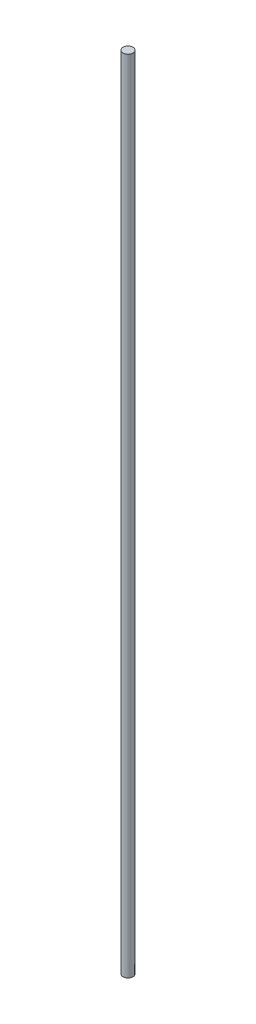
ISO-10303-21;
HEADER;
FILE_DESCRIPTION(('STEP AP214'),'2;1');
FILE_NAME('part.step','',(''),(''),'','','');
FILE_SCHEMA(('AUTOMOTIVE_DESIGN { 1 0 10303 214 1 1 1 1 }'));
ENDSEC;
DATA;
#1=APPLICATION_CONTEXT('core data for automotive mechanical design processes');
#2=APPLICATION_PROTOCOL_DEFINITION('international standard','automotive_design',2000,#1);
#3=PRODUCT_CONTEXT('',#1,'mechanical');
#4=PRODUCT('Part','Part','',(#3));
#5=PRODUCT_RELATED_PRODUCT_CATEGORY('part','',(#4));
#6=PRODUCT_DEFINITION_FORMATION('','',#4);
#7=PRODUCT_DEFINITION_CONTEXT('part definition',#1,'design');
#8=PRODUCT_DEFINITION('design','',#6,#7);
#9=PRODUCT_DEFINITION_SHAPE('','',#8);
#10=(LENGTH_UNIT() NAMED_UNIT(*) SI_UNIT(.MILLI.,.METRE.));
#11=(NAMED_UNIT(*) PLANE_ANGLE_UNIT() SI_UNIT($,.RADIAN.));
#12=(NAMED_UNIT(*) SI_UNIT($,.STERADIAN.) SOLID_ANGLE_UNIT());
#13=UNCERTAINTY_MEASURE_WITH_UNIT(LENGTH_MEASURE(1.E-05),#10,'distance_accuracy_value','');
#14=(GEOMETRIC_REPRESENTATION_CONTEXT(3) GLOBAL_UNCERTAINTY_ASSIGNED_CONTEXT((#13)) GLOBAL_UNIT_ASSIGNED_CONTEXT((#10,
#11,#12)) REPRESENTATION_CONTEXT('',''));
#15=CARTESIAN_POINT('',(0.,0.,0.));
#16=DIRECTION('',(0.,0.,1.));
#17=DIRECTION('',(1.,0.,0.));
#18=AXIS2_PLACEMENT_3D('',#15,#16,#17);
#19=CARTESIAN_POINT('',(0.,762.,0.));
#20=DIRECTION('',(0.,-1.,0.));
#21=DIRECTION('',(0.,0.,-1.));
#22=AXIS2_PLACEMENT_3D('',#19,#20,#21);
#23=CYLINDRICAL_SURFACE('',#22,4.826);
#24=CARTESIAN_POINT('',(0.,762.,0.));
#25=DIRECTION('',(0.,1.,0.));
#26=DIRECTION('',(0.,0.,1.));
#27=AXIS2_PLACEMENT_3D('',#24,#25,#26);
#28=CIRCLE('',#27,4.826);
#29=CARTESIAN_POINT('',(0.,762.,4.826));
#30=VERTEX_POINT('',#29);
#31=EDGE_CURVE('E10',#30,#30,#28,.T.);
#32=ORIENTED_EDGE('',*,*,#31,.F.);
#33=EDGE_LOOP('',(#32));
#34=FACE_BOUND('',#33,.T.);
#35=CARTESIAN_POINT('',(0.,0.,0.));
#36=DIRECTION('',(0.,1.,0.));
#37=DIRECTION('',(0.,0.,1.));
#38=AXIS2_PLACEMENT_3D('',#35,#36,#37);
#39=CIRCLE('',#38,4.826);
#40=CARTESIAN_POINT('',(0.,0.,4.826));
#41=VERTEX_POINT('',#40);
#42=EDGE_CURVE('E33',#41,#41,#39,.T.);
#43=ORIENTED_EDGE('',*,*,#42,.T.);
#44=EDGE_LOOP('',(#43));
#45=FACE_BOUND('',#44,.T.);
#46=ADVANCED_FACE('F30',(#34,#45),#23,.T.);
#47=CARTESIAN_POINT('',(0.,762.,0.));
#48=DIRECTION('',(0.,1.,0.));
#49=DIRECTION('',(0.,0.,1.));
#50=AXIS2_PLACEMENT_3D('',#47,#48,#49);
#51=PLANE('',#50);
#52=ORIENTED_EDGE('',*,*,#31,.T.);
#53=EDGE_LOOP('',(#52));
#54=FACE_BOUND('',#53,.T.);
#55=ADVANCED_FACE('F45',(#54),#51,.T.);
#56=CARTESIAN_POINT('',(0.,0.,0.));
#57=DIRECTION('',(0.,1.,0.));
#58=DIRECTION('',(0.,0.,1.));
#59=AXIS2_PLACEMENT_3D('',#56,#57,#58);
#60=PLANE('',#59);
#61=ORIENTED_EDGE('',*,*,#42,.F.);
#62=EDGE_LOOP('',(#61));
#63=FACE_BOUND('',#62,.T.);
#64=ADVANCED_FACE('F43',(#63),#60,.F.);
#65=CLOSED_SHELL('',(#46,#55,#64));
#66=MANIFOLD_SOLID_BREP('B2',#65);
#67=ADVANCED_BREP_SHAPE_REPRESENTATION('',(#18,#66),#14);
#68=SHAPE_DEFINITION_REPRESENTATION(#9,#67);
ENDSEC;
END-ISO-10303-21;
